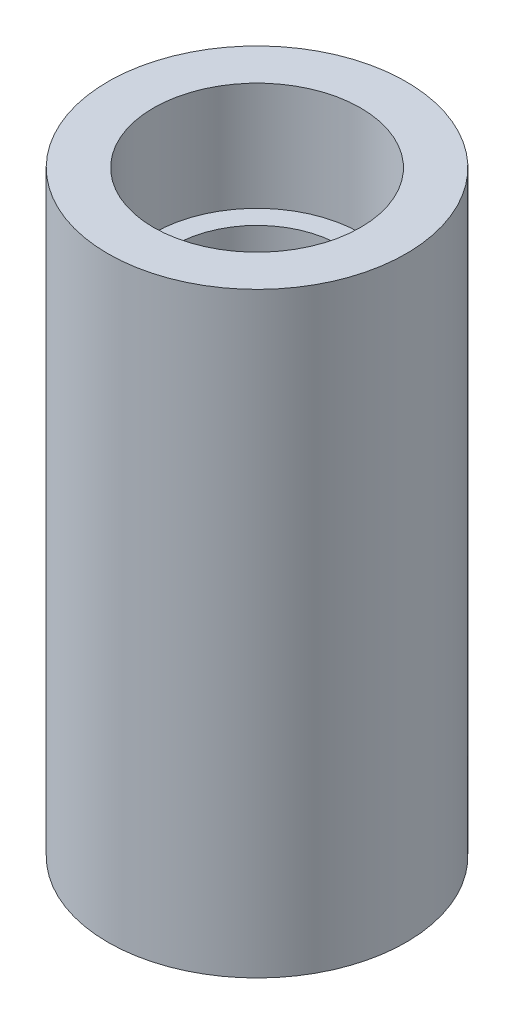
from build123d import *

# Parameters (mm, degrees)
SKETCH1_R           = 6.985
BOSS_EXTRUDE1_DEPTH = 27.94
SKETCH2_R           = 4.8514
CUT_EXTRUDE1_DEPTH  = 5.08
SKETCH3_R           = 3.8735
CUT_EXTRUDE2_DEPTH  = 2.54
SKETCH4_R           = 4.7625
CUT_EXTRUDE3_DEPTH  = 20.32


with BuildPart() as part:
    # Sketch1 → Boss-Extrude1 (new body)
    with BuildSketch(Plane(origin=(0, 0, 0), x_dir=(1, 0, 0), z_dir=(0, 1, 0))):
        with Locations(Location((0, 0, 0), (0, 0, 270))):
            Circle(SKETCH1_R)
    extrude(amount=BOSS_EXTRUDE1_DEPTH)

    # Sketch2 → Cut-Extrude1 (cut)
    with BuildSketch(Plane(origin=(0, 27.94, 0), x_dir=(1, 0, 0), z_dir=(0, 1, 0))):
        with Locations(Location((0, 0, 0), (0, 0, 270))):
            Circle(SKETCH2_R)
    extrude(amount=-CUT_EXTRUDE1_DEPTH, mode=Mode.SUBTRACT)

    # Sketch3 → Cut-Extrude2 (cut)
    with BuildSketch(Plane(origin=(0, 22.86, 0), x_dir=(1, 0, 0), z_dir=(0, 1, 0))):
        with Locations(Location((0, 0, 0), (0, 0, 270))):
            Circle(SKETCH3_R)
    extrude(amount=-CUT_EXTRUDE2_DEPTH, mode=Mode.SUBTRACT)

    # Sketch4 → Cut-Extrude3 (cut)
    with BuildSketch(Plane.XZ):
        with Locations(Location((0, 0, 0), (0, 0, 270))):
            Circle(SKETCH4_R)
    extrude(amount=-CUT_EXTRUDE3_DEPTH, mode=Mode.SUBTRACT)


solid = part.part
